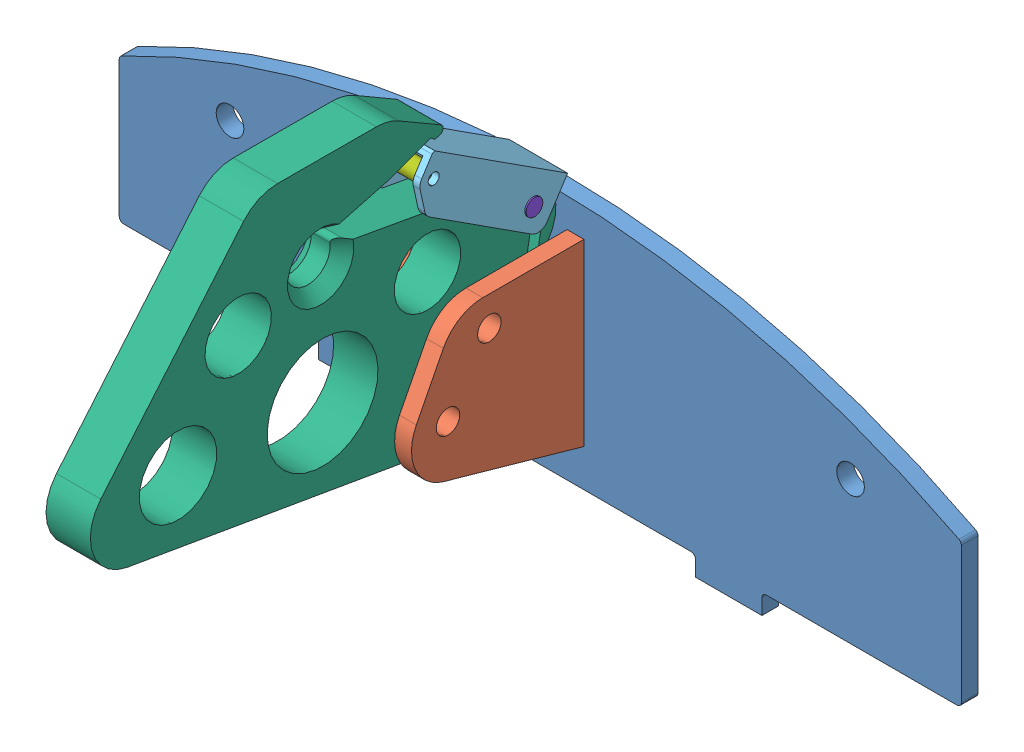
SolidWorks assembly TowhookAssemblyShort.SLDASM, configuration Default (file format 12000). Lengths in mm.
Overall size (241.3 132.47 149.96).
11 component instances, 8 part files, 8 mates.
Components (placement in the parent):
- Mounting Plate, Tow Hook-1: Mounting Plate, Tow Hook.SLDPRT [for waterjetting] at (46.3114 -135.3934 67.5464) size (241.3 76.51 4.76)
- Towhook_sideplates-1: Towhook_sideplates.SLDPRT [Default] at (40.0249 64.2583 72.3089) x (0 0 1) z (-1 0 0) size (49.42 51.42 4.83)
- Towhook_sideplates-2: Towhook_sideplates.SLDPRT [Default] at (58.8209 64.2583 72.3089) x (0 0 1) z (-1 0 0) size (49.42 51.42 4.83)
- Assembly,Towhook-1: Assembly,Towhook.sldasm [Default] at (40.0249 127.6408 83.3799) x (0 -0.176477 -0.984305) z (1 0 0) size (138.56 85.75 17.53)
  - Spring_towhook-1: Spring_towhook.SLDPRT [Default] at (0 0 10.3411) x (-0.713591 -0.700562 0) z (0 0 1) size (29.23 41.53 7.33)
  - Bushing_towhook-1: Bushing_towhook.SLDPRT [Default] at origin size (11.43 11.43 12.7)
  - Latch.Multibeam-1: Latch.Multibeam.SLDPRT [Default] at (3.7716 -7.9067 0.5715) x (-0.922731 0.385444 0) z (0 0 -1) size (45.72 13.97 16.76)
  - Latch.Multibeam-2: Latch.Multibeam.SLDPRT [Default] at (3.7716 -7.9067 0.5715) x (-0.922731 0.385444 0) z (0 0 -1) size (45.72 13.97 16.76)
  - MultiBeam AUV Towhook-1: MultiBeam AUV Towhook.SLDPRT [Aluminum] at (-67.9605 -107.5486 6.35) x (0.999975 0.007129 0) z (0 0 1) size (129.21 84.83 14.48)
  - Latch_stop-1: Latch_stop.SLDPRT [Default] at (-31.7671 15.7472 -0.0077) x (0.867001 -0.498307 0) z (0 0 1) size (5.08 5.08 13.21)
  - Pin_towhook-1: Pin_towhook.SLDPRT [Default] at (0 0 -1.828) x (0.197314 -0.98034 0) z (0 0 1) size (4.78 4.78 17.53)
Mates (geometry in assembly coordinates):
- Coincident1: coincident: plane of Mounting Plate, Tow Hook-1 through (46.3114 -135.3934 72.3089) normal (0 0 1); plane of Towhook_sideplates-2 through (53.9949 64.2583 72.3089) normal (0 0 -1)
- Coincident2: coincident: plane of Mounting Plate, Tow Hook-1 through (46.3114 -135.3934 72.3089) normal (0 0 1); plane of Towhook_sideplates-1 through (35.1989 64.2583 72.3089) normal (0 0 -1)
- Distance1: distance = 13.97 mm: plane of Towhook_sideplates-1 through (40.0249 79.8506 127.3882) normal (1 0 0); plane of Towhook_sideplates-2 through (53.9949 79.8506 127.3882) normal (-1 0 0)
- Coincident4: coincident: plane of Towhook_sideplates-1 through (35.1989 115.6763 72.3089) normal (0 1 0); plane of Towhook_sideplates-2 through (53.9949 115.6763 72.3089) normal (0 1 0)
- Coincident6: coincident: plane of Towhook_sideplates-1 through (40.0249 79.8506 127.3882) normal (1 0 0); plane of Assembly,Towhook-1/MultiBeam AUV Towhook-1 through (40.0249 140.5098 141.6661) normal (-1 0 0)
- Concentric1: concentric: circle of Towhook_sideplates-1; circle of Assembly,Towhook-1/MultiBeam AUV Towhook-1
- Concentric2: concentric: circle of Towhook_sideplates-1; circle of Assembly,Towhook-1/MultiBeam AUV Towhook-1
- Lock1: lock: unknown of Mounting Plate, Tow Hook-1; unknown of Towhook_sideplates-1
